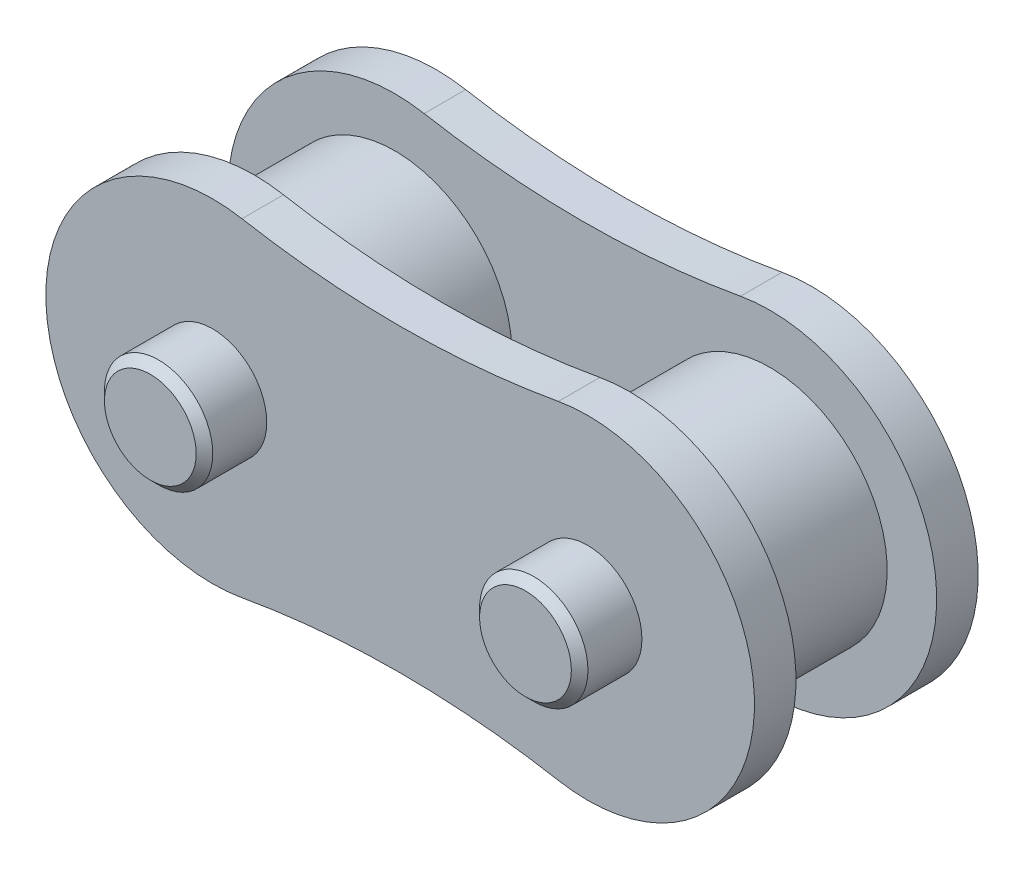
from build123d import *

# Parameters (mm, degrees)
SKETCH_2_R                 = 2.5
EXTRUDE_1_DEPTH            = 1.5
EXTRUDE_1_2_DEPTH          = 1.5
EXTRUDE_2_DEPTH            = 0.885
SKETCH_4_R                 = 1.155
EXTRUDE_3_DEPTH            = 1.3275
CHAMFER_1_SIZE             = 0.177
CHAMFER_1_OF_MIRROR_1_SIZE = 0.177


with BuildPart() as part:
    # Sketch 2 → Extrude 1 (new, symmetric)
    with BuildSketch(Plane.XY):
        with Locations((4, 0)):
            Circle(SKETCH_2_R)
    extrude(amount=EXTRUDE_1_DEPTH, both=True)



with BuildPart() as body_2:
    # Sketch 2 → Extrude 1 2 (new, symmetric)
    with BuildSketch(Plane.XY):
        with Locations((-4, 0)):
            Circle(SKETCH_2_R)
    extrude(amount=EXTRUDE_1_2_DEPTH, both=True)


with BuildPart() as part_1:
    add(part.part)

    add(body_2.part)  # Extrude 2 merges body 2
    # Sketch 3 → Extrude 2 (add)
    with BuildSketch(Plane.XY.offset(1.5)):
        with BuildLine():
            ThreePointArc((-3.373050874, 3.499279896), (-7.555, 0), (-3.373050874, -3.499279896))
            ThreePointArc((-3.373050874, -3.499279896), (0, -3.1995), (3.373050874, -3.499279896))
            ThreePointArc((3.373050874, -3.499279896), (7.555, 0), (3.373050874, 3.499279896))
            ThreePointArc((3.373050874, 3.499279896), (0, 3.1995), (-3.373050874, 3.499279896))
        make_face()
    extrude_2 = extrude(amount=EXTRUDE_2_DEPTH)

    # Sketch 4 → Extrude 3 (add)
    with BuildSketch(Plane.XY.offset(2.385)):
        with Locations((4, 0)):
            Circle(SKETCH_4_R)
        with Locations((-4, 0)):
            Circle(SKETCH_4_R)
    extrude_3 = extrude(amount=EXTRUDE_3_DEPTH)

    # Chamfer 1
    chamfer_1_edges = [part_1.edges().sort_by_distance(p)[0] for p in [
        (2.845, 0, 3.7125),
        (-5.155, 0, 3.7125),
    ]]
    chamfer(chamfer_1_edges, length=CHAMFER_1_SIZE)

    # Mirror 1: Extrude 2, Extrude 3 across plane
    add(extrude_2.mirror(Plane.XY))
    add(extrude_3.mirror(Plane.XY))

    # Chamfer 1 of Mirror 1
    chamfer_1_of_mirror_1_edges = [part_1.edges().sort_by_distance(p)[0] for p in [
        (2.845, 0, -3.7125),
        (-5.155, 0, -3.7125),
    ]]
    chamfer(chamfer_1_of_mirror_1_edges, length=CHAMFER_1_OF_MIRROR_1_SIZE)


solid = part_1.part
